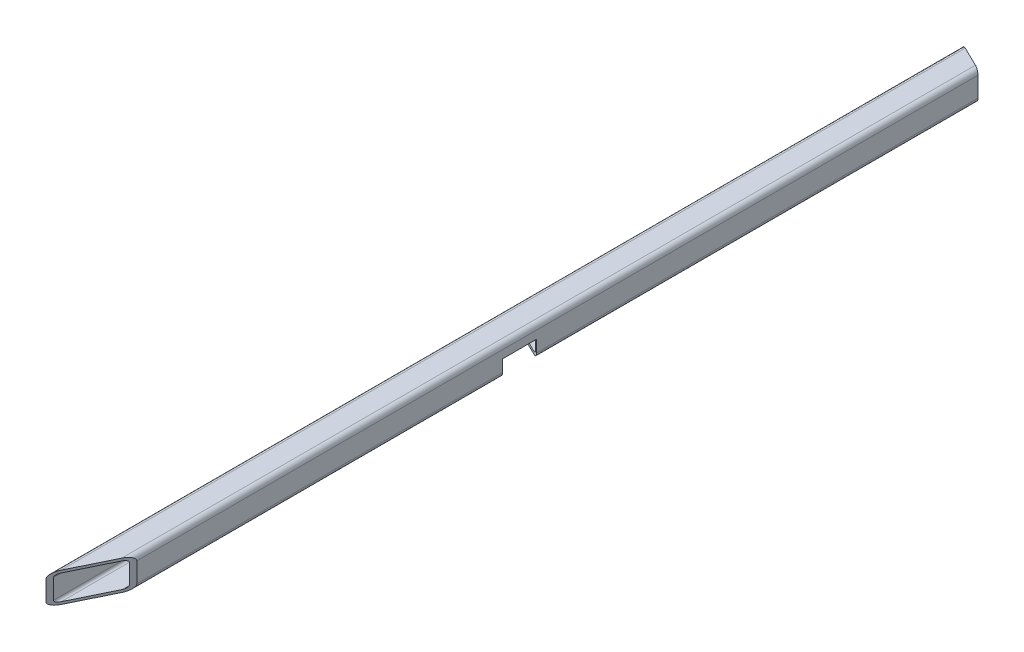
ISO-10303-21;
HEADER;
FILE_DESCRIPTION(('STEP AP214'),'2;1');
FILE_NAME('part.step','',(''),(''),'','','');
FILE_SCHEMA(('AUTOMOTIVE_DESIGN { 1 0 10303 214 1 1 1 1 }'));
ENDSEC;
DATA;
#1=APPLICATION_CONTEXT('core data for automotive mechanical design processes');
#2=APPLICATION_PROTOCOL_DEFINITION('international standard','automotive_design',2000,#1);
#3=PRODUCT_CONTEXT('',#1,'mechanical');
#4=PRODUCT('Part','Part','',(#3));
#5=PRODUCT_RELATED_PRODUCT_CATEGORY('part','',(#4));
#6=PRODUCT_DEFINITION_FORMATION('','',#4);
#7=PRODUCT_DEFINITION_CONTEXT('part definition',#1,'design');
#8=PRODUCT_DEFINITION('design','',#6,#7);
#9=PRODUCT_DEFINITION_SHAPE('','',#8);
#10=(LENGTH_UNIT() NAMED_UNIT(*) SI_UNIT(.MILLI.,.METRE.));
#11=(NAMED_UNIT(*) PLANE_ANGLE_UNIT() SI_UNIT($,.RADIAN.));
#12=(NAMED_UNIT(*) SI_UNIT($,.STERADIAN.) SOLID_ANGLE_UNIT());
#13=UNCERTAINTY_MEASURE_WITH_UNIT(LENGTH_MEASURE(1.E-05),#10,'distance_accuracy_value','');
#14=(GEOMETRIC_REPRESENTATION_CONTEXT(3) GLOBAL_UNCERTAINTY_ASSIGNED_CONTEXT((#13)) GLOBAL_UNIT_ASSIGNED_CONTEXT((#10,
#11,#12)) REPRESENTATION_CONTEXT('',''));
#15=CARTESIAN_POINT('',(0.,0.,0.));
#16=DIRECTION('',(0.,0.,1.));
#17=DIRECTION('',(1.,0.,0.));
#18=AXIS2_PLACEMENT_3D('',#15,#16,#17);
#19=CARTESIAN_POINT('',(-20.,-20.,1847.32));
#20=DIRECTION('',(0.,0.,-1.));
#21=DIRECTION('',(-1.,0.,0.));
#22=AXIS2_PLACEMENT_3D('',#19,#20,#21);
#23=CYLINDRICAL_SURFACE('',#22,10.);
#24=DIRECTION('',(0.,0.,-1.));
#25=VECTOR('',#24,1.);
#26=CARTESIAN_POINT('',(-30.,-20.,1847.32));
#27=LINE('',#26,#25);
#28=CARTESIAN_POINT('',(-30.,-20.,1847.32));
#29=VERTEX_POINT('',#28);
#30=CARTESIAN_POINT('',(-30.,-20.,958.351049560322));
#31=VERTEX_POINT('',#30);
#32=EDGE_CURVE('E367',#29,#31,#27,.T.);
#33=ORIENTED_EDGE('',*,*,#32,.T.);
#34=CARTESIAN_POINT('',(-20.,-20.,963.228375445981));
#35=DIRECTION('',(-0.438371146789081,0.,0.898794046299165));
#36=DIRECTION('',(-0.898794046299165,0.,-0.438371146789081));
#37=AXIS2_PLACEMENT_3D('',#34,#35,#36);
#38=ELLIPSE('',#37,11.1260194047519,10.);
#39=CARTESIAN_POINT('',(-20.0000000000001,-30.,963.228375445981));
#40=VERTEX_POINT('',#39);
#41=EDGE_CURVE('E238',#31,#40,#38,.T.);
#42=ORIENTED_EDGE('',*,*,#41,.T.);
#43=DIRECTION('',(0.,0.,-1.));
#44=VECTOR('',#43,1.);
#45=CARTESIAN_POINT('',(-20.,-30.,1847.32));
#46=LINE('',#45,#44);
#47=CARTESIAN_POINT('',(-20.,-30.,1826.81696158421));
#48=VERTEX_POINT('',#47);
#49=EDGE_CURVE('E363',#48,#40,#46,.T.);
#50=ORIENTED_EDGE('',*,*,#49,.F.);
#51=CARTESIAN_POINT('',(-20.,-20.,1826.81696158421));
#52=DIRECTION('',(-0.898794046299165,0.,-0.438371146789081));
#53=DIRECTION('',(0.438371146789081,0.,-0.898794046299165));
#54=AXIS2_PLACEMENT_3D('',#51,#52,#53);
#55=ELLIPSE('',#54,22.8117203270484,10.);
#56=EDGE_CURVE('E311',#48,#29,#55,.T.);
#57=ORIENTED_EDGE('',*,*,#56,.T.);
#58=EDGE_LOOP('',(#33,#42,#50,#57));
#59=FACE_BOUND('',#58,.T.);
#60=ADVANCED_FACE('F32',(#59),#23,.T.);
#61=CARTESIAN_POINT('',(-20.,-30.,1847.32));
#62=DIRECTION('',(0.,1.,0.));
#63=DIRECTION('',(-1.,0.,0.));
#64=AXIS2_PLACEMENT_3D('',#61,#62,#63);
#65=PLANE('',#64);
#66=ORIENTED_EDGE('',*,*,#49,.T.);
#67=DIRECTION('',(-0.898794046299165,0.,-0.438371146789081));
#68=VECTOR('',#67,1.);
#69=CARTESIAN_POINT('',(-147.490968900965,-30.,901.046875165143));
#70=LINE('',#69,#68);
#71=CARTESIAN_POINT('',(20.,-30.,982.737678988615));
#72=VERTEX_POINT('',#71);
#73=EDGE_CURVE('E543',#72,#40,#70,.T.);
#74=ORIENTED_EDGE('',*,*,#73,.F.);
#75=DIRECTION('',(0.,0.,-1.));
#76=VECTOR('',#75,1.);
#77=CARTESIAN_POINT('',(20.,-30.,1847.32));
#78=LINE('',#77,#76);
#79=CARTESIAN_POINT('',(20.,-30.,1744.80480792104));
#80=VERTEX_POINT('',#79);
#81=EDGE_CURVE('E359',#80,#72,#78,.T.);
#82=ORIENTED_EDGE('',*,*,#81,.F.);
#83=DIRECTION('',(-0.438371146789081,0.,0.898794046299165));
#84=VECTOR('',#83,1.);
#85=CARTESIAN_POINT('',(-30.,-30.,1847.32));
#86=LINE('',#85,#84);
#87=EDGE_CURVE('E288',#80,#48,#86,.T.);
#88=ORIENTED_EDGE('',*,*,#87,.T.);
#89=EDGE_LOOP('',(#66,#74,#82,#88));
#90=FACE_BOUND('',#89,.T.);
#91=ADVANCED_FACE('F487',(#90),#65,.F.);
#92=CARTESIAN_POINT('',(20.,-20.,1847.32));
#93=DIRECTION('',(0.,0.,-1.));
#94=DIRECTION('',(-1.,0.,0.));
#95=AXIS2_PLACEMENT_3D('',#92,#93,#94);
#96=CYLINDRICAL_SURFACE('',#95,10.);
#97=ORIENTED_EDGE('',*,*,#81,.T.);
#98=CARTESIAN_POINT('',(20.,-20.,982.737678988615));
#99=DIRECTION('',(-0.438371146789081,0.,0.898794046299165));
#100=DIRECTION('',(-0.898794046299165,0.,-0.438371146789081));
#101=AXIS2_PLACEMENT_3D('',#98,#99,#100);
#102=ELLIPSE('',#101,11.1260194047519,10.);
#103=CARTESIAN_POINT('',(30.,-20.,987.615004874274));
#104=VERTEX_POINT('',#103);
#105=EDGE_CURVE('E235',#72,#104,#102,.T.);
#106=ORIENTED_EDGE('',*,*,#105,.T.);
#107=DIRECTION('',(0.,0.,-1.));
#108=VECTOR('',#107,1.);
#109=CARTESIAN_POINT('',(30.,-20.,1847.32));
#110=LINE('',#109,#108);
#111=CARTESIAN_POINT('',(30.,-20.,1724.30176950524));
#112=VERTEX_POINT('',#111);
#113=EDGE_CURVE('E234',#112,#104,#110,.T.);
#114=ORIENTED_EDGE('',*,*,#113,.F.);
#115=CARTESIAN_POINT('',(20.,-20.,1744.80480792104));
#116=DIRECTION('',(-0.898794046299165,0.,-0.438371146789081));
#117=DIRECTION('',(0.438371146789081,0.,-0.898794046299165));
#118=AXIS2_PLACEMENT_3D('',#115,#116,#117);
#119=ELLIPSE('',#118,22.8117203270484,10.);
#120=EDGE_CURVE('E308',#112,#80,#119,.T.);
#121=ORIENTED_EDGE('',*,*,#120,.T.);
#122=EDGE_LOOP('',(#97,#106,#114,#121));
#123=FACE_BOUND('',#122,.T.);
#124=ADVANCED_FACE('F494',(#123),#96,.T.);
#125=CARTESIAN_POINT('',(-20.,-20.,1847.32));
#126=DIRECTION('',(0.,0.,-1.));
#127=DIRECTION('',(-1.,0.,0.));
#128=AXIS2_PLACEMENT_3D('',#125,#126,#127);
#129=CYLINDRICAL_SURFACE('',#128,5.);
#130=CARTESIAN_POINT('',(-20.,-20.,963.228375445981));
#131=DIRECTION('',(-0.438371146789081,0.,0.898794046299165));
#132=DIRECTION('',(-0.898794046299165,0.,-0.438371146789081));
#133=AXIS2_PLACEMENT_3D('',#130,#131,#132);
#134=ELLIPSE('',#133,5.56300970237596,5.);
#135=CARTESIAN_POINT('',(-25.,-20.,960.789712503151));
#136=VERTEX_POINT('',#135);
#137=CARTESIAN_POINT('',(-20.0000000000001,-25.,963.228375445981));
#138=VERTEX_POINT('',#137);
#139=EDGE_CURVE('E240',#136,#138,#134,.T.);
#140=ORIENTED_EDGE('',*,*,#139,.F.);
#141=DIRECTION('',(0.,0.,-1.));
#142=VECTOR('',#141,1.);
#143=CARTESIAN_POINT('',(-25.,-20.,1847.32));
#144=LINE('',#143,#142);
#145=CARTESIAN_POINT('',(-25.,-20.,1837.0684807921));
#146=VERTEX_POINT('',#145);
#147=EDGE_CURVE('E342',#146,#136,#144,.T.);
#148=ORIENTED_EDGE('',*,*,#147,.F.);
#149=CARTESIAN_POINT('',(-20.,-20.,1826.81696158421));
#150=DIRECTION('',(-0.898794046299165,0.,-0.438371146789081));
#151=DIRECTION('',(0.438371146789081,0.,-0.898794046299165));
#152=AXIS2_PLACEMENT_3D('',#149,#150,#151);
#153=ELLIPSE('',#152,11.4058601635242,5.);
#154=CARTESIAN_POINT('',(-20.,-25.,1826.81696158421));
#155=VERTEX_POINT('',#154);
#156=EDGE_CURVE('E302',#155,#146,#153,.T.);
#157=ORIENTED_EDGE('',*,*,#156,.F.);
#158=DIRECTION('',(0.,0.,-1.));
#159=VECTOR('',#158,1.);
#160=CARTESIAN_POINT('',(-20.,-25.,1847.32));
#161=LINE('',#160,#159);
#162=EDGE_CURVE('E338',#155,#138,#161,.T.);
#163=ORIENTED_EDGE('',*,*,#162,.T.);
#164=EDGE_LOOP('',(#140,#148,#157,#163));
#165=FACE_BOUND('',#164,.T.);
#166=ADVANCED_FACE('F467',(#165),#129,.F.);
#167=CARTESIAN_POINT('',(-20.,-25.,1847.32));
#168=DIRECTION('',(0.,1.,0.));
#169=DIRECTION('',(-1.,0.,0.));
#170=AXIS2_PLACEMENT_3D('',#167,#168,#169);
#171=PLANE('',#170);
#172=DIRECTION('',(0.898794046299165,0.,0.438371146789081));
#173=VECTOR('',#172,1.);
#174=CARTESIAN_POINT('',(328.336853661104,-25.,1133.123610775));
#175=LINE('',#174,#173);
#176=CARTESIAN_POINT('',(20.,-25.,982.737678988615));
#177=VERTEX_POINT('',#176);
#178=EDGE_CURVE('E456',#138,#177,#175,.T.);
#179=ORIENTED_EDGE('',*,*,#178,.F.);
#180=ORIENTED_EDGE('',*,*,#162,.F.);
#181=DIRECTION('',(-0.438371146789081,0.,0.898794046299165));
#182=VECTOR('',#181,1.);
#183=CARTESIAN_POINT('',(-28.0783073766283,-25.,1843.37994623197));
#184=LINE('',#183,#182);
#185=CARTESIAN_POINT('',(20.,-25.,1744.80480792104));
#186=VERTEX_POINT('',#185);
#187=EDGE_CURVE('E300',#186,#155,#184,.T.);
#188=ORIENTED_EDGE('',*,*,#187,.F.);
#189=DIRECTION('',(0.,0.,-1.));
#190=VECTOR('',#189,1.);
#191=CARTESIAN_POINT('',(20.,-25.,1847.32));
#192=LINE('',#191,#190);
#193=EDGE_CURVE('E334',#186,#177,#192,.T.);
#194=ORIENTED_EDGE('',*,*,#193,.T.);
#195=EDGE_LOOP('',(#179,#180,#188,#194));
#196=FACE_BOUND('',#195,.T.);
#197=ADVANCED_FACE('F463',(#196),#171,.T.);
#198=CARTESIAN_POINT('',(20.,-20.,1847.32));
#199=DIRECTION('',(0.,0.,-1.));
#200=DIRECTION('',(-1.,0.,0.));
#201=AXIS2_PLACEMENT_3D('',#198,#199,#200);
#202=CYLINDRICAL_SURFACE('',#201,5.00000000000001);
#203=CARTESIAN_POINT('',(20.,-20.,982.737678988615));
#204=DIRECTION('',(-0.438371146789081,0.,0.898794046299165));
#205=DIRECTION('',(-0.898794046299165,0.,-0.438371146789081));
#206=AXIS2_PLACEMENT_3D('',#203,#204,#205);
#207=ELLIPSE('',#206,5.56300970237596,5.00000000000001);
#208=CARTESIAN_POINT('',(25.,-20.,985.176341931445));
#209=VERTEX_POINT('',#208);
#210=EDGE_CURVE('E454',#177,#209,#207,.T.);
#211=ORIENTED_EDGE('',*,*,#210,.F.);
#212=ORIENTED_EDGE('',*,*,#193,.F.);
#213=CARTESIAN_POINT('',(20.,-20.,1744.80480792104));
#214=DIRECTION('',(-0.898794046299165,0.,-0.438371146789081));
#215=DIRECTION('',(0.438371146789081,0.,-0.898794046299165));
#216=AXIS2_PLACEMENT_3D('',#213,#214,#215);
#217=ELLIPSE('',#216,11.4058601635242,5.00000000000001);
#218=CARTESIAN_POINT('',(25.,-20.,1734.55328871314));
#219=VERTEX_POINT('',#218);
#220=EDGE_CURVE('E298',#219,#186,#217,.T.);
#221=ORIENTED_EDGE('',*,*,#220,.F.);
#222=DIRECTION('',(0.,0.,-1.));
#223=VECTOR('',#222,1.);
#224=CARTESIAN_POINT('',(25.,-20.,1847.32));
#225=LINE('',#224,#223);
#226=EDGE_CURVE('E330',#219,#209,#225,.T.);
#227=ORIENTED_EDGE('',*,*,#226,.T.);
#228=EDGE_LOOP('',(#211,#212,#221,#227));
#229=FACE_BOUND('',#228,.T.);
#230=ADVANCED_FACE('F473',(#229),#202,.F.);
#231=CARTESIAN_POINT('',(20.,20.,1847.32));
#232=DIRECTION('',(0.,0.,-1.));
#233=DIRECTION('',(-1.,0.,0.));
#234=AXIS2_PLACEMENT_3D('',#231,#232,#233);
#235=CYLINDRICAL_SURFACE('',#234,10.);
#236=DIRECTION('',(0.,0.,-1.));
#237=VECTOR('',#236,1.);
#238=CARTESIAN_POINT('',(30.,20.,1847.32));
#239=LINE('',#238,#237);
#240=CARTESIAN_POINT('',(30.,20.,1724.30176950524));
#241=VERTEX_POINT('',#240);
#242=CARTESIAN_POINT('',(30.,20.,29.2639553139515));
#243=VERTEX_POINT('',#242);
#244=EDGE_CURVE('E351',#241,#243,#239,.T.);
#245=ORIENTED_EDGE('',*,*,#244,.T.);
#246=CARTESIAN_POINT('',(20.,20.,24.3866294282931));
#247=DIRECTION('',(-0.438371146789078,0.,0.898794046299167));
#248=DIRECTION('',(-0.898794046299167,0.,-0.438371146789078));
#249=AXIS2_PLACEMENT_3D('',#246,#247,#248);
#250=ELLIPSE('',#249,11.1260194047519,10.);
#251=CARTESIAN_POINT('',(20.0000000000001,30.,24.3866294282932));
#252=VERTEX_POINT('',#251);
#253=EDGE_CURVE('E284',#243,#252,#250,.T.);
#254=ORIENTED_EDGE('',*,*,#253,.T.);
#255=DIRECTION('',(0.,0.,-1.));
#256=VECTOR('',#255,1.);
#257=CARTESIAN_POINT('',(20.,30.,1847.32));
#258=LINE('',#257,#256);
#259=CARTESIAN_POINT('',(20.,30.,1744.80480792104));
#260=VERTEX_POINT('',#259);
#261=EDGE_CURVE('E376',#260,#252,#258,.T.);
#262=ORIENTED_EDGE('',*,*,#261,.F.);
#263=CARTESIAN_POINT('',(20.,20.,1744.80480792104));
#264=DIRECTION('',(-0.898794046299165,0.,-0.438371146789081));
#265=DIRECTION('',(0.438371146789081,0.,-0.898794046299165));
#266=AXIS2_PLACEMENT_3D('',#263,#264,#265);
#267=ELLIPSE('',#266,22.8117203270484,10.);
#268=EDGE_CURVE('E317',#260,#241,#267,.T.);
#269=ORIENTED_EDGE('',*,*,#268,.T.);
#270=EDGE_LOOP('',(#245,#254,#262,#269));
#271=FACE_BOUND('',#270,.T.);
#272=ADVANCED_FACE('F34',(#271),#235,.T.);
#273=CARTESIAN_POINT('',(20.,30.,1847.32));
#274=DIRECTION('',(0.,-1.,0.));
#275=DIRECTION('',(1.,0.,0.));
#276=AXIS2_PLACEMENT_3D('',#273,#274,#275);
#277=PLANE('',#276);
#278=ORIENTED_EDGE('',*,*,#261,.T.);
#279=DIRECTION('',(0.898794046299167,0.,0.438371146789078));
#280=VECTOR('',#279,1.);
#281=CARTESIAN_POINT('',(-30.,30.,0.));
#282=LINE('',#281,#280);
#283=CARTESIAN_POINT('',(-20.,30.,4.87732588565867));
#284=VERTEX_POINT('',#283);
#285=EDGE_CURVE('E249',#284,#252,#282,.T.);
#286=ORIENTED_EDGE('',*,*,#285,.F.);
#287=DIRECTION('',(0.,0.,-1.));
#288=VECTOR('',#287,1.);
#289=CARTESIAN_POINT('',(-20.,30.,1847.32));
#290=LINE('',#289,#288);
#291=CARTESIAN_POINT('',(-20.,30.,1826.81696158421));
#292=VERTEX_POINT('',#291);
#293=EDGE_CURVE('E373',#292,#284,#290,.T.);
#294=ORIENTED_EDGE('',*,*,#293,.F.);
#295=DIRECTION('',(-0.438371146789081,0.,0.898794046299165));
#296=VECTOR('',#295,1.);
#297=CARTESIAN_POINT('',(-30.,30.,1847.32));
#298=LINE('',#297,#296);
#299=EDGE_CURVE('E287',#260,#292,#298,.T.);
#300=ORIENTED_EDGE('',*,*,#299,.F.);
#301=EDGE_LOOP('',(#278,#286,#294,#300));
#302=FACE_BOUND('',#301,.T.);
#303=ADVANCED_FACE('F481',(#302),#277,.F.);
#304=CARTESIAN_POINT('',(-20.,20.,1847.32));
#305=DIRECTION('',(0.,0.,-1.));
#306=DIRECTION('',(-1.,0.,0.));
#307=AXIS2_PLACEMENT_3D('',#304,#305,#306);
#308=CYLINDRICAL_SURFACE('',#307,10.);
#309=ORIENTED_EDGE('',*,*,#293,.T.);
#310=CARTESIAN_POINT('',(-20.,20.,4.8773258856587));
#311=DIRECTION('',(-0.438371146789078,0.,0.898794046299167));
#312=DIRECTION('',(-0.898794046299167,0.,-0.438371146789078));
#313=AXIS2_PLACEMENT_3D('',#310,#311,#312);
#314=ELLIPSE('',#313,11.1260194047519,10.);
#315=CARTESIAN_POINT('',(-30.,20.,0.));
#316=VERTEX_POINT('',#315);
#317=EDGE_CURVE('E281',#284,#316,#314,.T.);
#318=ORIENTED_EDGE('',*,*,#317,.T.);
#319=DIRECTION('',(0.,0.,-1.));
#320=VECTOR('',#319,1.);
#321=CARTESIAN_POINT('',(-30.,20.,1847.32));
#322=LINE('',#321,#320);
#323=CARTESIAN_POINT('',(-30.,20.,1847.32));
#324=VERTEX_POINT('',#323);
#325=EDGE_CURVE('E370',#324,#316,#322,.T.);
#326=ORIENTED_EDGE('',*,*,#325,.F.);
#327=CARTESIAN_POINT('',(-20.,20.,1826.81696158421));
#328=DIRECTION('',(-0.898794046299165,0.,-0.438371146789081));
#329=DIRECTION('',(0.438371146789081,0.,-0.898794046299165));
#330=AXIS2_PLACEMENT_3D('',#327,#328,#329);
#331=ELLIPSE('',#330,22.8117203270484,10.);
#332=EDGE_CURVE('E314',#324,#292,#331,.T.);
#333=ORIENTED_EDGE('',*,*,#332,.T.);
#334=EDGE_LOOP('',(#309,#318,#326,#333));
#335=FACE_BOUND('',#334,.T.);
#336=ADVANCED_FACE('F508',(#335),#308,.T.);
#337=CARTESIAN_POINT('',(-30.,-20.,1847.32));
#338=DIRECTION('',(1.,0.,0.));
#339=DIRECTION('',(0.,1.,0.));
#340=AXIS2_PLACEMENT_3D('',#337,#338,#339);
#341=PLANE('',#340);
#342=DIRECTION('',(0.,0.,-1.));
#343=VECTOR('',#342,1.);
#344=CARTESIAN_POINT('',(-30.,4.00000000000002,1847.32));
#345=LINE('',#344,#343);
#346=CARTESIAN_POINT('',(-30.,4.,958.351049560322));
#347=VERTEX_POINT('',#346);
#348=CARTESIAN_POINT('',(-30.,4.,889.36972925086));
#349=VERTEX_POINT('',#348);
#350=EDGE_CURVE('E218',#347,#349,#345,.T.);
#351=ORIENTED_EDGE('',*,*,#350,.F.);
#352=DIRECTION('',(0.,-1.,0.));
#353=VECTOR('',#352,1.);
#354=CARTESIAN_POINT('',(-30.,-20.0000000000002,958.351049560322));
#355=LINE('',#354,#353);
#356=EDGE_CURVE('E246',#347,#31,#355,.T.);
#357=ORIENTED_EDGE('',*,*,#356,.T.);
#358=ORIENTED_EDGE('',*,*,#32,.F.);
#359=DIRECTION('',(0.,-1.,0.));
#360=VECTOR('',#359,1.);
#361=CARTESIAN_POINT('',(-30.,-20.,1847.32));
#362=LINE('',#361,#360);
#363=EDGE_CURVE('E349',#324,#29,#362,.T.);
#364=ORIENTED_EDGE('',*,*,#363,.F.);
#365=ORIENTED_EDGE('',*,*,#325,.T.);
#366=DIRECTION('',(0.,-1.,0.));
#367=VECTOR('',#366,1.);
#368=CARTESIAN_POINT('',(-30.,-20.,0.));
#369=LINE('',#368,#367);
#370=CARTESIAN_POINT('',(-30.,-20.,0.));
#371=VERTEX_POINT('',#370);
#372=EDGE_CURVE('E348',#316,#371,#369,.T.);
#373=ORIENTED_EDGE('',*,*,#372,.T.);
#374=CARTESIAN_POINT('',(-30.,-20.,889.36972925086));
#375=VERTEX_POINT('',#374);
#376=EDGE_CURVE('E366',#375,#371,#27,.T.);
#377=ORIENTED_EDGE('',*,*,#376,.F.);
#378=DIRECTION('',(0.,1.,0.));
#379=VECTOR('',#378,1.);
#380=CARTESIAN_POINT('',(-30.,-20.0000000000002,889.36972925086));
#381=LINE('',#380,#379);
#382=EDGE_CURVE('E451',#375,#349,#381,.T.);
#383=ORIENTED_EDGE('',*,*,#382,.T.);
#384=EDGE_LOOP('',(#351,#357,#358,#364,#365,#373,#377,#383));
#385=FACE_BOUND('',#384,.T.);
#386=ADVANCED_FACE('F500',(#385),#341,.F.);
#387=CARTESIAN_POINT('',(-20.0000000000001,-30.,894.247055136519));
#388=VERTEX_POINT('',#387);
#389=CARTESIAN_POINT('',(-20.0000000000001,-30.,4.87732588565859));
#390=VERTEX_POINT('',#389);
#391=EDGE_CURVE('E362',#388,#390,#46,.T.);
#392=ORIENTED_EDGE('',*,*,#391,.F.);
#393=CARTESIAN_POINT('',(-20.,-20.,894.247055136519));
#394=DIRECTION('',(0.438371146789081,0.,-0.898794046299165));
#395=DIRECTION('',(-0.898794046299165,0.,-0.438371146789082));
#396=AXIS2_PLACEMENT_3D('',#393,#394,#395);
#397=ELLIPSE('',#396,11.1260194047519,10.);
#398=EDGE_CURVE('E448',#388,#375,#397,.T.);
#399=ORIENTED_EDGE('',*,*,#398,.T.);
#400=ORIENTED_EDGE('',*,*,#376,.T.);
#401=CARTESIAN_POINT('',(-20.,-20.,4.8773258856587));
#402=DIRECTION('',(-0.438371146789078,0.,0.898794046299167));
#403=DIRECTION('',(-0.898794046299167,0.,-0.438371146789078));
#404=AXIS2_PLACEMENT_3D('',#401,#402,#403);
#405=ELLIPSE('',#404,11.1260194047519,10.);
#406=EDGE_CURVE('E278',#371,#390,#405,.T.);
#407=ORIENTED_EDGE('',*,*,#406,.T.);
#408=EDGE_LOOP('',(#392,#399,#400,#407));
#409=FACE_BOUND('',#408,.T.);
#410=ADVANCED_FACE('F490',(#409),#23,.T.);
#411=CARTESIAN_POINT('',(20.,-30.,913.756358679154));
#412=VERTEX_POINT('',#411);
#413=CARTESIAN_POINT('',(20.,-30.,24.3866294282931));
#414=VERTEX_POINT('',#413);
#415=EDGE_CURVE('E358',#412,#414,#78,.T.);
#416=ORIENTED_EDGE('',*,*,#415,.F.);
#417=DIRECTION('',(0.898794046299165,0.,0.438371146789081));
#418=VECTOR('',#417,1.);
#419=CARTESIAN_POINT('',(-120.311957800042,-30.,845.321644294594));
#420=LINE('',#419,#418);
#421=EDGE_CURVE('E516',#388,#412,#420,.T.);
#422=ORIENTED_EDGE('',*,*,#421,.F.);
#423=ORIENTED_EDGE('',*,*,#391,.T.);
#424=DIRECTION('',(0.898794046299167,0.,0.438371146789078));
#425=VECTOR('',#424,1.);
#426=CARTESIAN_POINT('',(-30.,-30.,0.));
#427=LINE('',#426,#425);
#428=EDGE_CURVE('E250',#390,#414,#427,.T.);
#429=ORIENTED_EDGE('',*,*,#428,.T.);
#430=EDGE_LOOP('',(#416,#422,#423,#429));
#431=FACE_BOUND('',#430,.T.);
#432=ADVANCED_FACE('F497',(#431),#65,.F.);
#433=CARTESIAN_POINT('',(30.,-20.,918.633684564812));
#434=VERTEX_POINT('',#433);
#435=CARTESIAN_POINT('',(30.,-20.,29.2639553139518));
#436=VERTEX_POINT('',#435);
#437=EDGE_CURVE('E356',#434,#436,#110,.T.);
#438=ORIENTED_EDGE('',*,*,#437,.F.);
#439=CARTESIAN_POINT('',(20.,-20.,913.756358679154));
#440=DIRECTION('',(0.438371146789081,0.,-0.898794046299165));
#441=DIRECTION('',(-0.898794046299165,0.,-0.438371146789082));
#442=AXIS2_PLACEMENT_3D('',#439,#440,#441);
#443=ELLIPSE('',#442,11.1260194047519,10.);
#444=EDGE_CURVE('E445',#434,#412,#443,.T.);
#445=ORIENTED_EDGE('',*,*,#444,.T.);
#446=ORIENTED_EDGE('',*,*,#415,.T.);
#447=CARTESIAN_POINT('',(20.,-20.,24.3866294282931));
#448=DIRECTION('',(-0.438371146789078,0.,0.898794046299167));
#449=DIRECTION('',(-0.898794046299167,0.,-0.438371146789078));
#450=AXIS2_PLACEMENT_3D('',#447,#448,#449);
#451=ELLIPSE('',#450,11.1260194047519,10.);
#452=EDGE_CURVE('E275',#414,#436,#451,.T.);
#453=ORIENTED_EDGE('',*,*,#452,.T.);
#454=EDGE_LOOP('',(#438,#445,#446,#453));
#455=FACE_BOUND('',#454,.T.);
#456=ADVANCED_FACE('F506',(#455),#96,.T.);
#457=CARTESIAN_POINT('',(30.,20.,1847.32));
#458=DIRECTION('',(-1.,0.,0.));
#459=DIRECTION('',(0.,0.,1.));
#460=AXIS2_PLACEMENT_3D('',#457,#458,#459);
#461=PLANE('',#460);
#462=ORIENTED_EDGE('',*,*,#113,.T.);
#463=DIRECTION('',(0.,1.,0.));
#464=VECTOR('',#463,1.);
#465=CARTESIAN_POINT('',(30.,20.,987.615004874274));
#466=LINE('',#465,#464);
#467=CARTESIAN_POINT('',(30.,4.,987.615004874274));
#468=VERTEX_POINT('',#467);
#469=EDGE_CURVE('E224',#104,#468,#466,.T.);
#470=ORIENTED_EDGE('',*,*,#469,.T.);
#471=DIRECTION('',(0.,0.,1.));
#472=VECTOR('',#471,1.);
#473=CARTESIAN_POINT('',(30.,4.00000000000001,1847.32));
#474=LINE('',#473,#472);
#475=CARTESIAN_POINT('',(30.,4.,918.633684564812));
#476=VERTEX_POINT('',#475);
#477=EDGE_CURVE('E213',#476,#468,#474,.T.);
#478=ORIENTED_EDGE('',*,*,#477,.F.);
#479=DIRECTION('',(0.,-1.,0.));
#480=VECTOR('',#479,1.);
#481=CARTESIAN_POINT('',(30.,20.,918.633684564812));
#482=LINE('',#481,#480);
#483=EDGE_CURVE('E443',#476,#434,#482,.T.);
#484=ORIENTED_EDGE('',*,*,#483,.T.);
#485=ORIENTED_EDGE('',*,*,#437,.T.);
#486=DIRECTION('',(0.,1.,0.));
#487=VECTOR('',#486,1.);
#488=CARTESIAN_POINT('',(30.,-30.,29.2639553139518));
#489=LINE('',#488,#487);
#490=EDGE_CURVE('E253',#436,#243,#489,.T.);
#491=ORIENTED_EDGE('',*,*,#490,.T.);
#492=ORIENTED_EDGE('',*,*,#244,.F.);
#493=DIRECTION('',(0.,1.,0.));
#494=VECTOR('',#493,1.);
#495=CARTESIAN_POINT('',(30.,-30.,1724.30176950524));
#496=LINE('',#495,#494);
#497=EDGE_CURVE('E291',#112,#241,#496,.T.);
#498=ORIENTED_EDGE('',*,*,#497,.F.);
#499=EDGE_LOOP('',(#462,#470,#478,#484,#485,#491,#492,#498));
#500=FACE_BOUND('',#499,.T.);
#501=ADVANCED_FACE('F231',(#500),#461,.F.);
#502=CARTESIAN_POINT('',(-20.,20.,1847.32));
#503=DIRECTION('',(0.,0.,-1.));
#504=DIRECTION('',(-1.,0.,0.));
#505=AXIS2_PLACEMENT_3D('',#502,#503,#504);
#506=CYLINDRICAL_SURFACE('',#505,5.00000000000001);
#507=CARTESIAN_POINT('',(-20.,20.,4.8773258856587));
#508=DIRECTION('',(-0.438371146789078,0.,0.898794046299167));
#509=DIRECTION('',(-0.898794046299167,0.,-0.438371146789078));
#510=AXIS2_PLACEMENT_3D('',#507,#508,#509);
#511=ELLIPSE('',#510,5.56300970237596,5.00000000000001);
#512=CARTESIAN_POINT('',(-20.0000000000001,25.,4.87732588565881));
#513=VERTEX_POINT('',#512);
#514=CARTESIAN_POINT('',(-25.,20.,2.43866294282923));
#515=VERTEX_POINT('',#514);
#516=EDGE_CURVE('E273',#513,#515,#511,.T.);
#517=ORIENTED_EDGE('',*,*,#516,.F.);
#518=DIRECTION('',(0.,0.,-1.));
#519=VECTOR('',#518,1.);
#520=CARTESIAN_POINT('',(-20.,25.,1847.32));
#521=LINE('',#520,#519);
#522=CARTESIAN_POINT('',(-20.,25.,1826.81696158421));
#523=VERTEX_POINT('',#522);
#524=EDGE_CURVE('E320',#523,#513,#521,.T.);
#525=ORIENTED_EDGE('',*,*,#524,.F.);
#526=CARTESIAN_POINT('',(-20.,20.,1826.81696158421));
#527=DIRECTION('',(-0.898794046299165,0.,-0.438371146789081));
#528=DIRECTION('',(0.438371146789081,0.,-0.898794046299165));
#529=AXIS2_PLACEMENT_3D('',#526,#527,#528);
#530=ELLIPSE('',#529,11.4058601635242,5.00000000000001);
#531=CARTESIAN_POINT('',(-25.,20.,1837.0684807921));
#532=VERTEX_POINT('',#531);
#533=EDGE_CURVE('E306',#532,#523,#530,.T.);
#534=ORIENTED_EDGE('',*,*,#533,.F.);
#535=DIRECTION('',(0.,0.,-1.));
#536=VECTOR('',#535,1.);
#537=CARTESIAN_POINT('',(-25.,20.,1847.32));
#538=LINE('',#537,#536);
#539=EDGE_CURVE('E345',#532,#515,#538,.T.);
#540=ORIENTED_EDGE('',*,*,#539,.T.);
#541=EDGE_LOOP('',(#517,#525,#534,#540));
#542=FACE_BOUND('',#541,.T.);
#543=ADVANCED_FACE('F418',(#542),#506,.F.);
#544=CARTESIAN_POINT('',(-25.,-20.,1847.32));
#545=DIRECTION('',(1.,0.,0.));
#546=DIRECTION('',(0.,1.,0.));
#547=AXIS2_PLACEMENT_3D('',#544,#545,#546);
#548=PLANE('',#547);
#549=DIRECTION('',(0.,-1.,0.));
#550=VECTOR('',#549,1.);
#551=CARTESIAN_POINT('',(-25.,-20.0000000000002,960.789712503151));
#552=LINE('',#551,#550);
#553=CARTESIAN_POINT('',(-25.,4.,960.789712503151));
#554=VERTEX_POINT('',#553);
#555=EDGE_CURVE('E236',#554,#136,#552,.T.);
#556=ORIENTED_EDGE('',*,*,#555,.F.);
#557=DIRECTION('',(0.,0.,-1.));
#558=VECTOR('',#557,1.);
#559=CARTESIAN_POINT('',(-25.,4.00000000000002,1847.32));
#560=LINE('',#559,#558);
#561=CARTESIAN_POINT('',(-25.,4.,891.80839219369));
#562=VERTEX_POINT('',#561);
#563=EDGE_CURVE('E219',#554,#562,#560,.T.);
#564=ORIENTED_EDGE('',*,*,#563,.T.);
#565=DIRECTION('',(0.,1.,0.));
#566=VECTOR('',#565,1.);
#567=CARTESIAN_POINT('',(-25.,-20.0000000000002,891.808392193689));
#568=LINE('',#567,#566);
#569=CARTESIAN_POINT('',(-25.,-20.,891.808392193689));
#570=VERTEX_POINT('',#569);
#571=EDGE_CURVE('E438',#570,#562,#568,.T.);
#572=ORIENTED_EDGE('',*,*,#571,.F.);
#573=CARTESIAN_POINT('',(-25.,-20.,2.43866294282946));
#574=VERTEX_POINT('',#573);
#575=EDGE_CURVE('E341',#570,#574,#144,.T.);
#576=ORIENTED_EDGE('',*,*,#575,.T.);
#577=DIRECTION('',(0.,-1.,0.));
#578=VECTOR('',#577,1.);
#579=CARTESIAN_POINT('',(-25.,-20.0000000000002,2.43866294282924));
#580=LINE('',#579,#578);
#581=EDGE_CURVE('E270',#515,#574,#580,.T.);
#582=ORIENTED_EDGE('',*,*,#581,.F.);
#583=ORIENTED_EDGE('',*,*,#539,.F.);
#584=DIRECTION('',(0.,1.,0.));
#585=VECTOR('',#584,1.);
#586=CARTESIAN_POINT('',(-25.,-20.,1837.0684807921));
#587=LINE('',#586,#585);
#588=EDGE_CURVE('E304',#146,#532,#587,.T.);
#589=ORIENTED_EDGE('',*,*,#588,.F.);
#590=ORIENTED_EDGE('',*,*,#147,.T.);
#591=EDGE_LOOP('',(#556,#564,#572,#576,#582,#583,#589,#590));
#592=FACE_BOUND('',#591,.T.);
#593=ADVANCED_FACE('F424',(#592),#548,.T.);
#594=CARTESIAN_POINT('',(-20.,-20.,894.247055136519));
#595=DIRECTION('',(0.438371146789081,0.,-0.898794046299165));
#596=DIRECTION('',(-0.898794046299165,0.,-0.438371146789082));
#597=AXIS2_PLACEMENT_3D('',#594,#595,#596);
#598=ELLIPSE('',#597,5.56300970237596,5.);
#599=CARTESIAN_POINT('',(-20.0000000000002,-25.,894.247055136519));
#600=VERTEX_POINT('',#599);
#601=EDGE_CURVE('E434',#600,#570,#598,.T.);
#602=ORIENTED_EDGE('',*,*,#601,.F.);
#603=CARTESIAN_POINT('',(-20.0000000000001,-25.,4.8773258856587));
#604=VERTEX_POINT('',#603);
#605=EDGE_CURVE('E337',#600,#604,#161,.T.);
#606=ORIENTED_EDGE('',*,*,#605,.T.);
#607=CARTESIAN_POINT('',(-20.,-20.,4.8773258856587));
#608=DIRECTION('',(-0.438371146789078,0.,0.898794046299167));
#609=DIRECTION('',(-0.898794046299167,0.,-0.438371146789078));
#610=AXIS2_PLACEMENT_3D('',#607,#608,#609);
#611=ELLIPSE('',#610,5.56300970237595,5.);
#612=EDGE_CURVE('E267',#574,#604,#611,.T.);
#613=ORIENTED_EDGE('',*,*,#612,.F.);
#614=ORIENTED_EDGE('',*,*,#575,.F.);
#615=EDGE_LOOP('',(#602,#606,#613,#614));
#616=FACE_BOUND('',#615,.T.);
#617=ADVANCED_FACE('F432',(#616),#129,.F.);
#618=DIRECTION('',(-0.898794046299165,0.,-0.438371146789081));
#619=VECTOR('',#618,1.);
#620=CARTESIAN_POINT('',(355.515864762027,-25.,1077.39837990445));
#621=LINE('',#620,#619);
#622=CARTESIAN_POINT('',(20.,-25.,913.756358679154));
#623=VERTEX_POINT('',#622);
#624=EDGE_CURVE('E396',#623,#600,#621,.T.);
#625=ORIENTED_EDGE('',*,*,#624,.F.);
#626=CARTESIAN_POINT('',(20.,-25.,24.3866294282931));
#627=VERTEX_POINT('',#626);
#628=EDGE_CURVE('E333',#623,#627,#192,.T.);
#629=ORIENTED_EDGE('',*,*,#628,.T.);
#630=DIRECTION('',(0.898794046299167,0.,0.438371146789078));
#631=VECTOR('',#630,1.);
#632=CARTESIAN_POINT('',(705.932320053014,-25.0000000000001,358.938175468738));
#633=LINE('',#632,#631);
#634=EDGE_CURVE('E264',#604,#627,#633,.T.);
#635=ORIENTED_EDGE('',*,*,#634,.F.);
#636=ORIENTED_EDGE('',*,*,#605,.F.);
#637=EDGE_LOOP('',(#625,#629,#635,#636));
#638=FACE_BOUND('',#637,.T.);
#639=ADVANCED_FACE('F436',(#638),#171,.T.);
#640=CARTESIAN_POINT('',(20.,-20.,913.756358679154));
#641=DIRECTION('',(0.438371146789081,0.,-0.898794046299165));
#642=DIRECTION('',(-0.898794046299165,0.,-0.438371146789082));
#643=AXIS2_PLACEMENT_3D('',#640,#641,#642);
#644=ELLIPSE('',#643,5.56300970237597,5.00000000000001);
#645=CARTESIAN_POINT('',(25.,-20.,916.195021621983));
#646=VERTEX_POINT('',#645);
#647=EDGE_CURVE('E388',#646,#623,#644,.T.);
#648=ORIENTED_EDGE('',*,*,#647,.F.);
#649=CARTESIAN_POINT('',(25.,-20.,26.8252923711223));
#650=VERTEX_POINT('',#649);
#651=EDGE_CURVE('E329',#646,#650,#225,.T.);
#652=ORIENTED_EDGE('',*,*,#651,.T.);
#653=CARTESIAN_POINT('',(20.,-20.,24.3866294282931));
#654=DIRECTION('',(-0.438371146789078,0.,0.898794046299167));
#655=DIRECTION('',(-0.898794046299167,0.,-0.438371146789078));
#656=AXIS2_PLACEMENT_3D('',#653,#654,#655);
#657=ELLIPSE('',#656,5.56300970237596,5.00000000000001);
#658=EDGE_CURVE('E261',#627,#650,#657,.T.);
#659=ORIENTED_EDGE('',*,*,#658,.F.);
#660=ORIENTED_EDGE('',*,*,#628,.F.);
#661=EDGE_LOOP('',(#648,#652,#659,#660));
#662=FACE_BOUND('',#661,.T.);
#663=ADVANCED_FACE('F394',(#662),#202,.F.);
#664=CARTESIAN_POINT('',(25.,20.,1847.32));
#665=DIRECTION('',(-1.,0.,0.));
#666=DIRECTION('',(0.,0.,1.));
#667=AXIS2_PLACEMENT_3D('',#664,#665,#666);
#668=PLANE('',#667);
#669=DIRECTION('',(0.,1.,0.));
#670=VECTOR('',#669,1.);
#671=CARTESIAN_POINT('',(25.,20.,985.176341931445));
#672=LINE('',#671,#670);
#673=CARTESIAN_POINT('',(25.,4.,985.176341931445));
#674=VERTEX_POINT('',#673);
#675=EDGE_CURVE('E11',#209,#674,#672,.T.);
#676=ORIENTED_EDGE('',*,*,#675,.F.);
#677=ORIENTED_EDGE('',*,*,#226,.F.);
#678=DIRECTION('',(0.,-1.,0.));
#679=VECTOR('',#678,1.);
#680=CARTESIAN_POINT('',(25.,20.,1734.55328871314));
#681=LINE('',#680,#679);
#682=CARTESIAN_POINT('',(25.,20.,1734.55328871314));
#683=VERTEX_POINT('',#682);
#684=EDGE_CURVE('E296',#683,#219,#681,.T.);
#685=ORIENTED_EDGE('',*,*,#684,.F.);
#686=DIRECTION('',(0.,0.,-1.));
#687=VECTOR('',#686,1.);
#688=CARTESIAN_POINT('',(25.,20.,1847.32));
#689=LINE('',#688,#687);
#690=CARTESIAN_POINT('',(25.,20.,26.8252923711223));
#691=VERTEX_POINT('',#690);
#692=EDGE_CURVE('E326',#683,#691,#689,.T.);
#693=ORIENTED_EDGE('',*,*,#692,.T.);
#694=DIRECTION('',(0.,1.,0.));
#695=VECTOR('',#694,1.);
#696=CARTESIAN_POINT('',(25.,20.0000000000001,26.8252923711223));
#697=LINE('',#696,#695);
#698=EDGE_CURVE('E259',#650,#691,#697,.T.);
#699=ORIENTED_EDGE('',*,*,#698,.F.);
#700=ORIENTED_EDGE('',*,*,#651,.F.);
#701=DIRECTION('',(0.,-1.,0.));
#702=VECTOR('',#701,1.);
#703=CARTESIAN_POINT('',(25.,20.,916.195021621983));
#704=LINE('',#703,#702);
#705=CARTESIAN_POINT('',(25.,4.,916.195021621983));
#706=VERTEX_POINT('',#705);
#707=EDGE_CURVE('E40',#706,#646,#704,.T.);
#708=ORIENTED_EDGE('',*,*,#707,.F.);
#709=DIRECTION('',(0.,0.,1.));
#710=VECTOR('',#709,1.);
#711=CARTESIAN_POINT('',(25.,4.00000000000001,1847.32));
#712=LINE('',#711,#710);
#713=EDGE_CURVE('E383',#706,#674,#712,.T.);
#714=ORIENTED_EDGE('',*,*,#713,.T.);
#715=EDGE_LOOP('',(#676,#677,#685,#693,#699,#700,#708,#714));
#716=FACE_BOUND('',#715,.T.);
#717=ADVANCED_FACE('F399',(#716),#668,.T.);
#718=CARTESIAN_POINT('',(20.,20.,1847.32));
#719=DIRECTION('',(0.,0.,-1.));
#720=DIRECTION('',(-1.,0.,0.));
#721=AXIS2_PLACEMENT_3D('',#718,#719,#720);
#722=CYLINDRICAL_SURFACE('',#721,5.00000000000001);
#723=CARTESIAN_POINT('',(20.,20.,24.3866294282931));
#724=DIRECTION('',(-0.438371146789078,0.,0.898794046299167));
#725=DIRECTION('',(-0.898794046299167,0.,-0.438371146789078));
#726=AXIS2_PLACEMENT_3D('',#723,#724,#725);
#727=ELLIPSE('',#726,5.56300970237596,5.00000000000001);
#728=CARTESIAN_POINT('',(20.,25.,24.3866294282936));
#729=VERTEX_POINT('',#728);
#730=EDGE_CURVE('E257',#691,#729,#727,.T.);
#731=ORIENTED_EDGE('',*,*,#730,.F.);
#732=ORIENTED_EDGE('',*,*,#692,.F.);
#733=CARTESIAN_POINT('',(20.,20.,1744.80480792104));
#734=DIRECTION('',(-0.898794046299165,0.,-0.438371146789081));
#735=DIRECTION('',(0.438371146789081,0.,-0.898794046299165));
#736=AXIS2_PLACEMENT_3D('',#733,#734,#735);
#737=ELLIPSE('',#736,11.4058601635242,5.00000000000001);
#738=CARTESIAN_POINT('',(20.,25.,1744.80480792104));
#739=VERTEX_POINT('',#738);
#740=EDGE_CURVE('E294',#739,#683,#737,.T.);
#741=ORIENTED_EDGE('',*,*,#740,.F.);
#742=DIRECTION('',(0.,0.,-1.));
#743=VECTOR('',#742,1.);
#744=CARTESIAN_POINT('',(20.,25.,1847.32));
#745=LINE('',#744,#743);
#746=EDGE_CURVE('E323',#739,#729,#745,.T.);
#747=ORIENTED_EDGE('',*,*,#746,.T.);
#748=EDGE_LOOP('',(#731,#732,#741,#747));
#749=FACE_BOUND('',#748,.T.);
#750=ADVANCED_FACE('F408',(#749),#722,.F.);
#751=CARTESIAN_POINT('',(20.,25.,1847.32));
#752=DIRECTION('',(0.,-1.,0.));
#753=DIRECTION('',(1.,0.,0.));
#754=AXIS2_PLACEMENT_3D('',#751,#752,#753);
#755=PLANE('',#754);
#756=DIRECTION('',(-0.898794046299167,0.,-0.438371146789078));
#757=VECTOR('',#756,1.);
#758=CARTESIAN_POINT('',(738.245549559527,25.0000000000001,374.698390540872));
#759=LINE('',#758,#757);
#760=EDGE_CURVE('E381',#729,#513,#759,.T.);
#761=ORIENTED_EDGE('',*,*,#760,.F.);
#762=ORIENTED_EDGE('',*,*,#746,.F.);
#763=DIRECTION('',(0.438371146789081,0.,-0.898794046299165));
#764=VECTOR('',#763,1.);
#765=CARTESIAN_POINT('',(-20.3915368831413,25.,1827.61973115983));
#766=LINE('',#765,#764);
#767=EDGE_CURVE('E379',#523,#739,#766,.T.);
#768=ORIENTED_EDGE('',*,*,#767,.F.);
#769=ORIENTED_EDGE('',*,*,#524,.T.);
#770=EDGE_LOOP('',(#761,#762,#768,#769));
#771=FACE_BOUND('',#770,.T.);
#772=ADVANCED_FACE('F413',(#771),#755,.T.);
#773=CARTESIAN_POINT('',(-30.,-30.,1847.32));
#774=DIRECTION('',(-0.898794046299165,0.,-0.438371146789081));
#775=DIRECTION('',(-0.438371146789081,0.,0.898794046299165));
#776=AXIS2_PLACEMENT_3D('',#773,#774,#775);
#777=PLANE('',#776);
#778=ORIENTED_EDGE('',*,*,#533,.T.);
#779=ORIENTED_EDGE('',*,*,#767,.T.);
#780=ORIENTED_EDGE('',*,*,#740,.T.);
#781=ORIENTED_EDGE('',*,*,#684,.T.);
#782=ORIENTED_EDGE('',*,*,#220,.T.);
#783=ORIENTED_EDGE('',*,*,#187,.T.);
#784=ORIENTED_EDGE('',*,*,#156,.T.);
#785=ORIENTED_EDGE('',*,*,#588,.T.);
#786=EDGE_LOOP('',(#778,#779,#780,#781,#782,#783,#784,#785));
#787=FACE_BOUND('',#786,.T.);
#788=ORIENTED_EDGE('',*,*,#299,.T.);
#789=ORIENTED_EDGE('',*,*,#332,.F.);
#790=ORIENTED_EDGE('',*,*,#363,.T.);
#791=ORIENTED_EDGE('',*,*,#56,.F.);
#792=ORIENTED_EDGE('',*,*,#87,.F.);
#793=ORIENTED_EDGE('',*,*,#120,.F.);
#794=ORIENTED_EDGE('',*,*,#497,.T.);
#795=ORIENTED_EDGE('',*,*,#268,.F.);
#796=EDGE_LOOP('',(#788,#789,#790,#791,#792,#793,#794,#795));
#797=FACE_BOUND('',#796,.T.);
#798=ADVANCED_FACE('F469',(#787,#797),#777,.F.);
#799=CARTESIAN_POINT('',(-30.,-30.,0.));
#800=DIRECTION('',(-0.438371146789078,0.,0.898794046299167));
#801=DIRECTION('',(0.898794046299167,0.,0.438371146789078));
#802=AXIS2_PLACEMENT_3D('',#799,#800,#801);
#803=PLANE('',#802);
#804=ORIENTED_EDGE('',*,*,#516,.T.);
#805=ORIENTED_EDGE('',*,*,#581,.T.);
#806=ORIENTED_EDGE('',*,*,#612,.T.);
#807=ORIENTED_EDGE('',*,*,#634,.T.);
#808=ORIENTED_EDGE('',*,*,#658,.T.);
#809=ORIENTED_EDGE('',*,*,#698,.T.);
#810=ORIENTED_EDGE('',*,*,#730,.T.);
#811=ORIENTED_EDGE('',*,*,#760,.T.);
#812=EDGE_LOOP('',(#804,#805,#806,#807,#808,#809,#810,#811));
#813=FACE_BOUND('',#812,.T.);
#814=ORIENTED_EDGE('',*,*,#490,.F.);
#815=ORIENTED_EDGE('',*,*,#452,.F.);
#816=ORIENTED_EDGE('',*,*,#428,.F.);
#817=ORIENTED_EDGE('',*,*,#406,.F.);
#818=ORIENTED_EDGE('',*,*,#372,.F.);
#819=ORIENTED_EDGE('',*,*,#317,.F.);
#820=ORIENTED_EDGE('',*,*,#285,.T.);
#821=ORIENTED_EDGE('',*,*,#253,.F.);
#822=EDGE_LOOP('',(#814,#815,#816,#817,#818,#819,#820,#821));
#823=FACE_BOUND('',#822,.T.);
#824=ADVANCED_FACE('F404',(#813,#823),#803,.F.);
#825=CARTESIAN_POINT('',(-147.490968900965,4.00000000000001,901.046875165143));
#826=DIRECTION('',(-0.438371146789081,0.,0.898794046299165));
#827=DIRECTION('',(0.898794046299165,0.,0.438371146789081));
#828=AXIS2_PLACEMENT_3D('',#825,#826,#827);
#829=PLANE('',#828);
#830=DIRECTION('',(-0.898794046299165,0.,-0.438371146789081));
#831=VECTOR('',#830,1.);
#832=CARTESIAN_POINT('',(-147.490968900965,4.00000000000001,901.046875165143));
#833=LINE('',#832,#831);
#834=EDGE_CURVE('E228',#554,#347,#833,.T.);
#835=ORIENTED_EDGE('',*,*,#834,.F.);
#836=ORIENTED_EDGE('',*,*,#555,.T.);
#837=ORIENTED_EDGE('',*,*,#139,.T.);
#838=ORIENTED_EDGE('',*,*,#178,.T.);
#839=ORIENTED_EDGE('',*,*,#210,.T.);
#840=ORIENTED_EDGE('',*,*,#675,.T.);
#841=EDGE_CURVE('E52',#468,#674,#833,.T.);
#842=ORIENTED_EDGE('',*,*,#841,.F.);
#843=ORIENTED_EDGE('',*,*,#469,.F.);
#844=ORIENTED_EDGE('',*,*,#105,.F.);
#845=ORIENTED_EDGE('',*,*,#73,.T.);
#846=ORIENTED_EDGE('',*,*,#41,.F.);
#847=ORIENTED_EDGE('',*,*,#356,.F.);
#848=EDGE_LOOP('',(#835,#836,#837,#838,#839,#840,#842,#843,#844,#845,#846,#847));
#849=FACE_BOUND('',#848,.T.);
#850=ADVANCED_FACE('F223',(#849),#829,.F.);
#851=CARTESIAN_POINT('',(-120.311957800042,4.00000000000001,845.321644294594));
#852=DIRECTION('',(0.438371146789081,0.,-0.898794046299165));
#853=DIRECTION('',(-0.898794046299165,0.,-0.438371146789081));
#854=AXIS2_PLACEMENT_3D('',#851,#852,#853);
#855=PLANE('',#854);
#856=ORIENTED_EDGE('',*,*,#398,.F.);
#857=ORIENTED_EDGE('',*,*,#421,.T.);
#858=ORIENTED_EDGE('',*,*,#444,.F.);
#859=ORIENTED_EDGE('',*,*,#483,.F.);
#860=DIRECTION('',(0.898794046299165,0.,0.438371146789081));
#861=VECTOR('',#860,1.);
#862=CARTESIAN_POINT('',(-120.311957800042,4.00000000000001,845.321644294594));
#863=LINE('',#862,#861);
#864=EDGE_CURVE('E47',#706,#476,#863,.T.);
#865=ORIENTED_EDGE('',*,*,#864,.F.);
#866=ORIENTED_EDGE('',*,*,#707,.T.);
#867=ORIENTED_EDGE('',*,*,#647,.T.);
#868=ORIENTED_EDGE('',*,*,#624,.T.);
#869=ORIENTED_EDGE('',*,*,#601,.T.);
#870=ORIENTED_EDGE('',*,*,#571,.T.);
#871=EDGE_CURVE('E539',#349,#562,#863,.T.);
#872=ORIENTED_EDGE('',*,*,#871,.F.);
#873=ORIENTED_EDGE('',*,*,#382,.F.);
#874=EDGE_LOOP('',(#856,#857,#858,#859,#865,#866,#867,#868,#869,#870,#872,#873));
#875=FACE_BOUND('',#874,.T.);
#876=ADVANCED_FACE('F387',(#875),#855,.F.);
#877=CARTESIAN_POINT('',(-120.311957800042,4.00000000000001,845.321644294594));
#878=DIRECTION('',(0.,-1.,0.));
#879=DIRECTION('',(1.,0.,0.));
#880=AXIS2_PLACEMENT_3D('',#877,#878,#879);
#881=PLANE('',#880);
#882=ORIENTED_EDGE('',*,*,#350,.T.);
#883=ORIENTED_EDGE('',*,*,#871,.T.);
#884=ORIENTED_EDGE('',*,*,#563,.F.);
#885=ORIENTED_EDGE('',*,*,#834,.T.);
#886=EDGE_LOOP('',(#882,#883,#884,#885));
#887=FACE_BOUND('',#886,.T.);
#888=ADVANCED_FACE('F535',(#887),#881,.T.);
#889=ORIENTED_EDGE('',*,*,#477,.T.);
#890=ORIENTED_EDGE('',*,*,#841,.T.);
#891=ORIENTED_EDGE('',*,*,#713,.F.);
#892=ORIENTED_EDGE('',*,*,#864,.T.);
#893=EDGE_LOOP('',(#889,#890,#891,#892));
#894=FACE_BOUND('',#893,.T.);
#895=ADVANCED_FACE('F214',(#894),#881,.T.);
#896=CLOSED_SHELL('',(#60,#91,#124,#166,#197,#230,#272,#303,#336,#386,#410,#432,#456,#501,#543,
#593,#617,#639,#663,#717,#750,#772,#798,#824,#850,#876,#888,#895));
#897=MANIFOLD_SOLID_BREP('B2',#896);
#898=ADVANCED_BREP_SHAPE_REPRESENTATION('',(#18,#897),#14);
#899=SHAPE_DEFINITION_REPRESENTATION(#9,#898);
ENDSEC;
END-ISO-10303-21;
